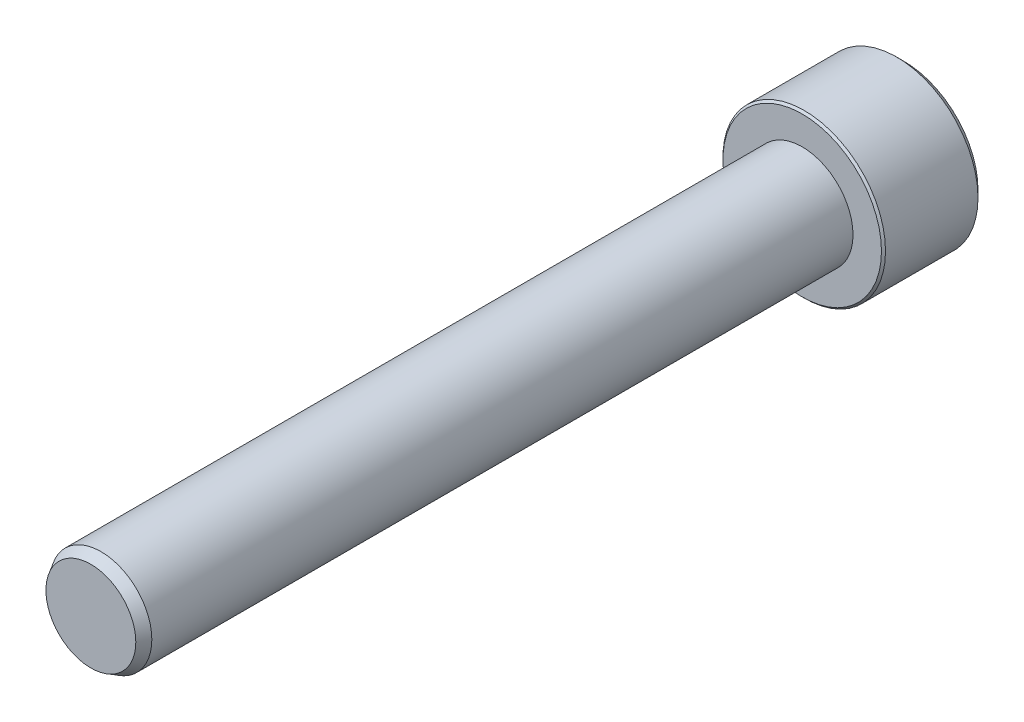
from build123d import *

# Parameters (mm, degrees)
ESQUISSE1_R             = 5
BASE_EXTRUSION_DEPTH    = 70
ESQUISSE2_R             = 8
BOSS_EXTRU_1_DEPTH      = 10
ENL_V_MAT_EXTRU_1_DEPTH = 5.5
CHANFREIN1_SIZE         = 0.7
CHANFREIN2_SIZE         = 1
CHANFREIN2_SIZE2        = 0.577350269
CHANFREIN3_SIZE         = 0.2


with BuildPart() as part:
    # Esquisse1 → Base-Extrusion (new body)
    with BuildSketch(Plane.XY):
        Circle(ESQUISSE1_R)
    extrude(amount=BASE_EXTRUSION_DEPTH)

    # Esquisse2 → Boss.-Extru.1 (add)
    with BuildSketch(Plane.XY):
        Circle(ESQUISSE2_R)
    extrude(amount=-BOSS_EXTRU_1_DEPTH)

    # Esquisse3 → Enl_v. mat.-Extru.1 (cut)
    with BuildSketch(Plane.XY.offset(-10)):
        Polygon((-2.309401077, 4), (2.309401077, 4), (4.618802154, 0), (2.309401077, -4), (-2.309401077, -4), (-4.618802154, 0), align=None)
    extrude(amount=ENL_V_MAT_EXTRU_1_DEPTH, mode=Mode.SUBTRACT)

    # Chanfrein1
    chanfrein1_edges = [part.edges().sort_by_distance(p)[0] for p in [
        (-8, 0, -10),
    ]]
    chamfer(chanfrein1_edges, length=CHANFREIN1_SIZE)

    # Chanfrein2
    chanfrein2_edges = [part.edges().sort_by_distance(p)[0] for p in [
        (-5, 0, 70),
    ]]
    chanfrein2_side = [part.faces().sort_by_distance(p)[0] for p in [
        (-5, 0, 35),
    ]]
    chamfer(chanfrein2_edges, length=CHANFREIN2_SIZE, length2=CHANFREIN2_SIZE2, reference=chanfrein2_side[0])

    # Chanfrein3
    chanfrein3_edges = [part.edges().sort_by_distance(p)[0] for p in [
        (-8, 0, 0),
    ]]
    chamfer(chanfrein3_edges, length=CHANFREIN3_SIZE)


solid = part.part
